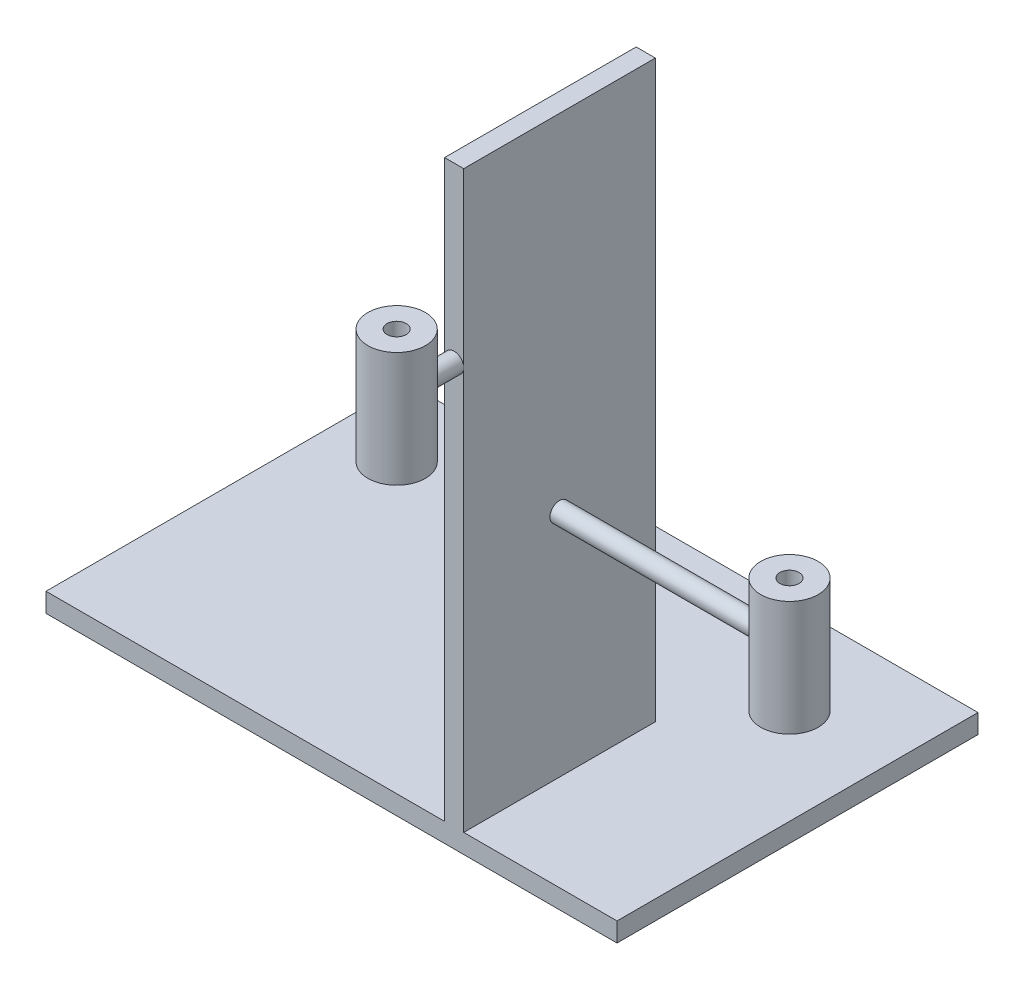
from build123d import *

# Parameters (mm, degrees)
BASE_EXTRUSION_DEPTH         = 15
BASE_EXTRUSION_DEPTH_BACK    = 15
ESQUISSE2_R                  = 7.5
ESQUISSE3_R                  = 2.5
BOSS_EXTRU_1_DEPTH           = 60
ESQUISSE4_W                  = 50
ESQUISSE4_H                  = 150
BOSS_EXTRU_2_DEPTH           = 5
ESQUISSE5_R                  = 2.5
BOSS_EXTRU_3_DEPTH           = 15
BOSS_EXTRU_4_DEPTH           = 15
BOSS_EXTRU_4_DEPTH_BACK      = 15
ESQUISSE6_R                  = 7.5
BOSS_EXTRU_5_DEPTH           = 40
BOSS_EXTRU_5_DEPTH_BACK      = 109
ESQUISSE7_W                  = 94.194289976
ESQUISSE7_H                  = 5
ENL_V_MAT_EXTRU_1_DEPTH      = 67
ENL_V_MAT_EXTRU_1_DEPTH_BACK = 35.986379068
ESQUISSE8_R                  = 2.5


with BuildPart() as part:
    # Esquisse2 → Base-Extrusion (new, two sides: drawn at the far end of the back side and taken through both)
    with BuildSketch(Plane(origin=(0, 0, 0), x_dir=(1, 0, 0), z_dir=(0, 1, 0)).offset(-BASE_EXTRUSION_DEPTH_BACK)):
        with Locations(Location((0, 0, 0), (0, 0, 270))):
            Circle(ESQUISSE2_R)
    extrude(amount=BASE_EXTRUSION_DEPTH + BASE_EXTRUSION_DEPTH_BACK)

    # Esquisse3 → Boss.-Extru.1 (add)
    with BuildSketch(Plane(origin=(0, 0, 0), x_dir=(0, 0, -1), z_dir=(1, 0, 0))):
        Circle(ESQUISSE3_R)
    extrude(amount=-BOSS_EXTRU_1_DEPTH)

    # Esquisse4 → Boss.-Extru.2 (add)
    with BuildSketch(Plane.ZY.offset(60)):
        with Locations((0, 15)):
            Rectangle(ESQUISSE4_W, ESQUISSE4_H)
    extrude(amount=BOSS_EXTRU_2_DEPTH)

    # Esquisse5 → Boss.-Extru.3 (add)
    with BuildSketch(Plane.XY.offset(25)):
        with Locations(Location((-62.5, 45, 0), (0, 0, 180))):
            Circle(ESQUISSE5_R)
    extrude(amount=BOSS_EXTRU_3_DEPTH)

    # Esquisse6 → Boss.-Extru.4 (add, two sides: drawn at the far end of the back side and taken through both)
    with BuildSketch(Plane(origin=(0, 45, 0), x_dir=(-1, 0, 0), z_dir=(0, 1, 0)).offset(-BOSS_EXTRU_4_DEPTH_BACK)):
        with Locations(Location((62.5, 40, 0), (0, 0, 90))):
            Circle(ESQUISSE6_R)
    extrude(amount=BOSS_EXTRU_4_DEPTH + BOSS_EXTRU_4_DEPTH_BACK)

    # Esquisse7 → Boss.-Extru.5 (add, two sides: drawn at the far end of the back side and taken through both)
    with BuildSketch(Plane(origin=(-60, 0, 0), x_dir=(0, 0, -1), z_dir=(1, 0, 0)).offset(-BOSS_EXTRU_5_DEPTH_BACK)):
        with Locations((22.097144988, -62.5)):
            Rectangle(ESQUISSE7_W, ESQUISSE7_H)
    extrude(amount=BOSS_EXTRU_5_DEPTH + BOSS_EXTRU_5_DEPTH_BACK)

    # Esquisse8 → Enl_v. mat.-Extru.1 (cut, two sides: drawn at the far end of the back side and taken through both)
    with BuildSketch(Plane(origin=(0, 15, 0), x_dir=(-1, 0, 0), z_dir=(0, 1, 0)).offset(-ENL_V_MAT_EXTRU_1_DEPTH_BACK)):
        with Locations(Location((0, 0, 0), (0, 0, 90))):
            Circle(ESQUISSE8_R)
        with Locations(Location((62.5, 40, 0), (0, 0, 90))):
            Circle(ESQUISSE8_R)
    extrude(amount=ENL_V_MAT_EXTRU_1_DEPTH + ENL_V_MAT_EXTRU_1_DEPTH_BACK, mode=Mode.SUBTRACT)


solid = part.part
